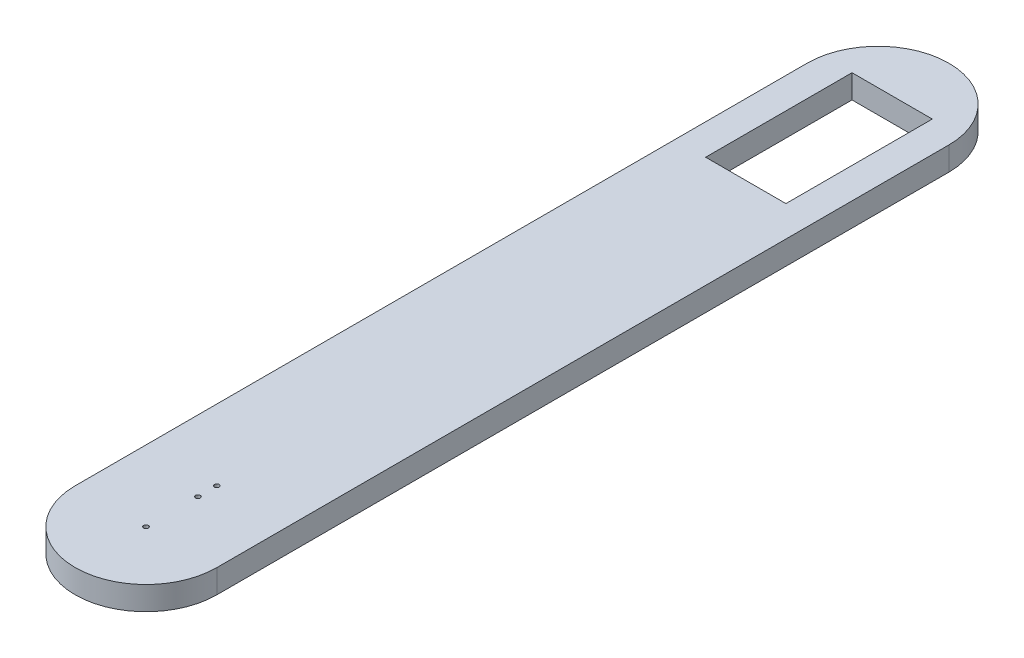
ISO-10303-21;
HEADER;
FILE_DESCRIPTION(('STEP AP214'),'2;1');
FILE_NAME('part.step','',(''),(''),'','','');
FILE_SCHEMA(('AUTOMOTIVE_DESIGN { 1 0 10303 214 1 1 1 1 }'));
ENDSEC;
DATA;
#1=APPLICATION_CONTEXT('core data for automotive mechanical design processes');
#2=APPLICATION_PROTOCOL_DEFINITION('international standard','automotive_design',2000,#1);
#3=PRODUCT_CONTEXT('',#1,'mechanical');
#4=PRODUCT('Part','Part','',(#3));
#5=PRODUCT_RELATED_PRODUCT_CATEGORY('part','',(#4));
#6=PRODUCT_DEFINITION_FORMATION('','',#4);
#7=PRODUCT_DEFINITION_CONTEXT('part definition',#1,'design');
#8=PRODUCT_DEFINITION('design','',#6,#7);
#9=PRODUCT_DEFINITION_SHAPE('','',#8);
#10=(LENGTH_UNIT() NAMED_UNIT(*) SI_UNIT(.MILLI.,.METRE.));
#11=(NAMED_UNIT(*) PLANE_ANGLE_UNIT() SI_UNIT($,.RADIAN.));
#12=(NAMED_UNIT(*) SI_UNIT($,.STERADIAN.) SOLID_ANGLE_UNIT());
#13=UNCERTAINTY_MEASURE_WITH_UNIT(LENGTH_MEASURE(1.E-05),#10,'distance_accuracy_value','');
#14=(GEOMETRIC_REPRESENTATION_CONTEXT(3) GLOBAL_UNCERTAINTY_ASSIGNED_CONTEXT((#13)) GLOBAL_UNIT_ASSIGNED_CONTEXT((#10,
#11,#12)) REPRESENTATION_CONTEXT('',''));
#15=CARTESIAN_POINT('',(0.,0.,0.));
#16=DIRECTION('',(0.,0.,1.));
#17=DIRECTION('',(1.,0.,0.));
#18=AXIS2_PLACEMENT_3D('',#15,#16,#17);
#19=CARTESIAN_POINT('',(15.,5.,0.));
#20=DIRECTION('',(0.,-1.,0.));
#21=DIRECTION('',(0.,0.,-1.));
#22=AXIS2_PLACEMENT_3D('',#19,#20,#21);
#23=CYLINDRICAL_SURFACE('',#22,15.);
#24=CARTESIAN_POINT('',(15.,0.,0.));
#25=DIRECTION('',(0.,1.,0.));
#26=DIRECTION('',(0.,0.,1.));
#27=AXIS2_PLACEMENT_3D('',#24,#25,#26);
#28=CIRCLE('',#27,15.);
#29=CARTESIAN_POINT('',(0.,0.,0.));
#30=VERTEX_POINT('',#29);
#31=CARTESIAN_POINT('',(30.,0.,0.));
#32=VERTEX_POINT('',#31);
#33=EDGE_CURVE('E156',#30,#32,#28,.T.);
#34=ORIENTED_EDGE('',*,*,#33,.T.);
#35=DIRECTION('',(0.,-1.,0.));
#36=VECTOR('',#35,1.);
#37=CARTESIAN_POINT('',(30.,5.,0.));
#38=LINE('',#37,#36);
#39=CARTESIAN_POINT('',(30.,5.,0.));
#40=VERTEX_POINT('',#39);
#41=EDGE_CURVE('E11',#40,#32,#38,.T.);
#42=ORIENTED_EDGE('',*,*,#41,.F.);
#43=CARTESIAN_POINT('',(15.,5.,0.));
#44=DIRECTION('',(0.,1.,0.));
#45=DIRECTION('',(0.,0.,1.));
#46=AXIS2_PLACEMENT_3D('',#43,#44,#45);
#47=CIRCLE('',#46,15.);
#48=CARTESIAN_POINT('',(0.,5.,0.));
#49=VERTEX_POINT('',#48);
#50=EDGE_CURVE('E144',#49,#40,#47,.T.);
#51=ORIENTED_EDGE('',*,*,#50,.F.);
#52=DIRECTION('',(0.,-1.,0.));
#53=VECTOR('',#52,1.);
#54=CARTESIAN_POINT('',(0.,5.,0.));
#55=LINE('',#54,#53);
#56=EDGE_CURVE('E155',#49,#30,#55,.T.);
#57=ORIENTED_EDGE('',*,*,#56,.T.);
#58=EDGE_LOOP('',(#34,#42,#51,#57));
#59=FACE_BOUND('',#58,.T.);
#60=ADVANCED_FACE('F32',(#59),#23,.T.);
#61=CARTESIAN_POINT('',(30.,5.,0.));
#62=DIRECTION('',(-1.,0.,0.));
#63=DIRECTION('',(0.,0.,1.));
#64=AXIS2_PLACEMENT_3D('',#61,#62,#63);
#65=PLANE('',#64);
#66=DIRECTION('',(0.,0.,-1.));
#67=VECTOR('',#66,1.);
#68=CARTESIAN_POINT('',(30.,0.,0.));
#69=LINE('',#68,#67);
#70=CARTESIAN_POINT('',(30.,0.,-155.));
#71=VERTEX_POINT('',#70);
#72=EDGE_CURVE('E159',#32,#71,#69,.T.);
#73=ORIENTED_EDGE('',*,*,#72,.T.);
#74=DIRECTION('',(0.,-1.,0.));
#75=VECTOR('',#74,1.);
#76=CARTESIAN_POINT('',(30.,5.,-155.));
#77=LINE('',#76,#75);
#78=CARTESIAN_POINT('',(30.,5.,-155.));
#79=VERTEX_POINT('',#78);
#80=EDGE_CURVE('E40',#79,#71,#77,.T.);
#81=ORIENTED_EDGE('',*,*,#80,.F.);
#82=DIRECTION('',(0.,0.,-1.));
#83=VECTOR('',#82,1.);
#84=CARTESIAN_POINT('',(30.,5.,0.));
#85=LINE('',#84,#83);
#86=EDGE_CURVE('E147',#40,#79,#85,.T.);
#87=ORIENTED_EDGE('',*,*,#86,.F.);
#88=ORIENTED_EDGE('',*,*,#41,.T.);
#89=EDGE_LOOP('',(#73,#81,#87,#88));
#90=FACE_BOUND('',#89,.T.);
#91=ADVANCED_FACE('F195',(#90),#65,.F.);
#92=CARTESIAN_POINT('',(15.,5.,-155.));
#93=DIRECTION('',(0.,-1.,0.));
#94=DIRECTION('',(0.,0.,-1.));
#95=AXIS2_PLACEMENT_3D('',#92,#93,#94);
#96=CYLINDRICAL_SURFACE('',#95,15.);
#97=CARTESIAN_POINT('',(15.,0.,-155.));
#98=DIRECTION('',(0.,1.,0.));
#99=DIRECTION('',(0.,0.,1.));
#100=AXIS2_PLACEMENT_3D('',#97,#98,#99);
#101=CIRCLE('',#100,15.);
#102=CARTESIAN_POINT('',(0.,0.,-155.));
#103=VERTEX_POINT('',#102);
#104=EDGE_CURVE('E161',#71,#103,#101,.T.);
#105=ORIENTED_EDGE('',*,*,#104,.T.);
#106=DIRECTION('',(0.,-1.,0.));
#107=VECTOR('',#106,1.);
#108=CARTESIAN_POINT('',(0.,5.,-155.));
#109=LINE('',#108,#107);
#110=CARTESIAN_POINT('',(0.,5.,-155.));
#111=VERTEX_POINT('',#110);
#112=EDGE_CURVE('E167',#111,#103,#109,.T.);
#113=ORIENTED_EDGE('',*,*,#112,.F.);
#114=CARTESIAN_POINT('',(15.,5.,-155.));
#115=DIRECTION('',(0.,1.,0.));
#116=DIRECTION('',(0.,0.,1.));
#117=AXIS2_PLACEMENT_3D('',#114,#115,#116);
#118=CIRCLE('',#117,15.);
#119=EDGE_CURVE('E150',#79,#111,#118,.T.);
#120=ORIENTED_EDGE('',*,*,#119,.F.);
#121=ORIENTED_EDGE('',*,*,#80,.T.);
#122=EDGE_LOOP('',(#105,#113,#120,#121));
#123=FACE_BOUND('',#122,.T.);
#124=ADVANCED_FACE('F200',(#123),#96,.T.);
#125=CARTESIAN_POINT('',(0.,5.,0.));
#126=DIRECTION('',(-1.,0.,0.));
#127=DIRECTION('',(0.,0.,1.));
#128=AXIS2_PLACEMENT_3D('',#125,#126,#127);
#129=PLANE('',#128);
#130=DIRECTION('',(0.,0.,-1.));
#131=VECTOR('',#130,1.);
#132=CARTESIAN_POINT('',(0.,0.,0.));
#133=LINE('',#132,#131);
#134=EDGE_CURVE('E148',#30,#103,#133,.T.);
#135=ORIENTED_EDGE('',*,*,#134,.F.);
#136=ORIENTED_EDGE('',*,*,#56,.F.);
#137=DIRECTION('',(0.,0.,-1.));
#138=VECTOR('',#137,1.);
#139=CARTESIAN_POINT('',(0.,5.,0.));
#140=LINE('',#139,#138);
#141=EDGE_CURVE('E152',#49,#111,#140,.T.);
#142=ORIENTED_EDGE('',*,*,#141,.T.);
#143=ORIENTED_EDGE('',*,*,#112,.T.);
#144=EDGE_LOOP('',(#135,#136,#142,#143));
#145=FACE_BOUND('',#144,.T.);
#146=ADVANCED_FACE('F209',(#145),#129,.T.);
#147=CARTESIAN_POINT('',(15.,5.,0.));
#148=DIRECTION('',(0.,1.,0.));
#149=DIRECTION('',(0.,0.,1.));
#150=AXIS2_PLACEMENT_3D('',#147,#148,#149);
#151=PLANE('',#150);
#152=DIRECTION('',(0.,0.,1.));
#153=VECTOR('',#152,1.);
#154=CARTESIAN_POINT('',(6.5,5.,-127.));
#155=LINE('',#154,#153);
#156=CARTESIAN_POINT('',(6.5,5.,-158.));
#157=VERTEX_POINT('',#156);
#158=CARTESIAN_POINT('',(6.5,5.,-127.));
#159=VERTEX_POINT('',#158);
#160=EDGE_CURVE('E48',#157,#159,#155,.T.);
#161=ORIENTED_EDGE('',*,*,#160,.F.);
#162=DIRECTION('',(-1.,0.,0.));
#163=VECTOR('',#162,1.);
#164=CARTESIAN_POINT('',(6.5,5.,-158.));
#165=LINE('',#164,#163);
#166=CARTESIAN_POINT('',(23.5,5.,-158.));
#167=VERTEX_POINT('',#166);
#168=EDGE_CURVE('E116',#167,#157,#165,.T.);
#169=ORIENTED_EDGE('',*,*,#168,.F.);
#170=DIRECTION('',(0.,0.,-1.));
#171=VECTOR('',#170,1.);
#172=CARTESIAN_POINT('',(23.5,5.,-158.));
#173=LINE('',#172,#171);
#174=CARTESIAN_POINT('',(23.5,5.,-127.));
#175=VERTEX_POINT('',#174);
#176=EDGE_CURVE('E119',#175,#167,#173,.T.);
#177=ORIENTED_EDGE('',*,*,#176,.F.);
#178=DIRECTION('',(1.,0.,0.));
#179=VECTOR('',#178,1.);
#180=CARTESIAN_POINT('',(23.5,5.,-127.));
#181=LINE('',#180,#179);
#182=EDGE_CURVE('E125',#159,#175,#181,.T.);
#183=ORIENTED_EDGE('',*,*,#182,.F.);
#184=EDGE_LOOP('',(#161,#169,#177,#183));
#185=FACE_BOUND('',#184,.T.);
#186=CARTESIAN_POINT('',(15.,5.,0.));
#187=DIRECTION('',(0.,1.,0.));
#188=DIRECTION('',(0.,0.,1.));
#189=AXIS2_PLACEMENT_3D('',#186,#187,#188);
#190=CIRCLE('',#189,0.500000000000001);
#191=CARTESIAN_POINT('',(15.,5.,0.500000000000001));
#192=VERTEX_POINT('',#191);
#193=EDGE_CURVE('E131',#192,#192,#190,.T.);
#194=ORIENTED_EDGE('',*,*,#193,.F.);
#195=EDGE_LOOP('',(#194));
#196=FACE_BOUND('',#195,.T.);
#197=CARTESIAN_POINT('',(15.,5.,-15.));
#198=DIRECTION('',(0.,1.,0.));
#199=DIRECTION('',(0.,0.,1.));
#200=AXIS2_PLACEMENT_3D('',#197,#198,#199);
#201=CIRCLE('',#200,0.500000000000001);
#202=CARTESIAN_POINT('',(15.,5.,-14.5));
#203=VERTEX_POINT('',#202);
#204=EDGE_CURVE('E135',#203,#203,#201,.T.);
#205=ORIENTED_EDGE('',*,*,#204,.F.);
#206=EDGE_LOOP('',(#205));
#207=FACE_BOUND('',#206,.T.);
#208=CARTESIAN_POINT('',(15.,5.,-11.));
#209=DIRECTION('',(0.,1.,0.));
#210=DIRECTION('',(0.,0.,1.));
#211=AXIS2_PLACEMENT_3D('',#208,#209,#210);
#212=CIRCLE('',#211,0.500000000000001);
#213=CARTESIAN_POINT('',(15.,5.,-10.5));
#214=VERTEX_POINT('',#213);
#215=EDGE_CURVE('E138',#214,#214,#212,.T.);
#216=ORIENTED_EDGE('',*,*,#215,.F.);
#217=EDGE_LOOP('',(#216));
#218=FACE_BOUND('',#217,.T.);
#219=ORIENTED_EDGE('',*,*,#50,.T.);
#220=ORIENTED_EDGE('',*,*,#86,.T.);
#221=ORIENTED_EDGE('',*,*,#119,.T.);
#222=ORIENTED_EDGE('',*,*,#141,.F.);
#223=EDGE_LOOP('',(#219,#220,#221,#222));
#224=FACE_BOUND('',#223,.T.);
#225=ADVANCED_FACE('F216',(#185,#196,#207,#218,#224),#151,.T.);
#226=CARTESIAN_POINT('',(15.,0.,0.));
#227=DIRECTION('',(0.,1.,0.));
#228=DIRECTION('',(0.,0.,1.));
#229=AXIS2_PLACEMENT_3D('',#226,#227,#228);
#230=PLANE('',#229);
#231=DIRECTION('',(-1.,0.,0.));
#232=VECTOR('',#231,1.);
#233=CARTESIAN_POINT('',(6.5,0.,-158.));
#234=LINE('',#233,#232);
#235=CARTESIAN_POINT('',(23.5,0.,-158.));
#236=VERTEX_POINT('',#235);
#237=CARTESIAN_POINT('',(6.5,0.,-158.));
#238=VERTEX_POINT('',#237);
#239=EDGE_CURVE('E106',#236,#238,#234,.T.);
#240=ORIENTED_EDGE('',*,*,#239,.T.);
#241=DIRECTION('',(0.,0.,1.));
#242=VECTOR('',#241,1.);
#243=CARTESIAN_POINT('',(6.5,0.,-127.));
#244=LINE('',#243,#242);
#245=CARTESIAN_POINT('',(6.5,0.,-127.));
#246=VERTEX_POINT('',#245);
#247=EDGE_CURVE('E100',#238,#246,#244,.T.);
#248=ORIENTED_EDGE('',*,*,#247,.T.);
#249=DIRECTION('',(1.,0.,0.));
#250=VECTOR('',#249,1.);
#251=CARTESIAN_POINT('',(23.5,0.,-127.));
#252=LINE('',#251,#250);
#253=CARTESIAN_POINT('',(23.5,0.,-127.));
#254=VERTEX_POINT('',#253);
#255=EDGE_CURVE('E109',#246,#254,#252,.T.);
#256=ORIENTED_EDGE('',*,*,#255,.T.);
#257=DIRECTION('',(0.,0.,-1.));
#258=VECTOR('',#257,1.);
#259=CARTESIAN_POINT('',(23.5,0.,-158.));
#260=LINE('',#259,#258);
#261=EDGE_CURVE('E56',#254,#236,#260,.T.);
#262=ORIENTED_EDGE('',*,*,#261,.T.);
#263=EDGE_LOOP('',(#240,#248,#256,#262));
#264=FACE_BOUND('',#263,.T.);
#265=CARTESIAN_POINT('',(15.,0.,0.));
#266=DIRECTION('',(0.,1.,0.));
#267=DIRECTION('',(0.,0.,1.));
#268=AXIS2_PLACEMENT_3D('',#265,#266,#267);
#269=CIRCLE('',#268,0.500000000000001);
#270=CARTESIAN_POINT('',(15.,0.,0.500000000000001));
#271=VERTEX_POINT('',#270);
#272=EDGE_CURVE('E35',#271,#271,#269,.T.);
#273=ORIENTED_EDGE('',*,*,#272,.T.);
#274=EDGE_LOOP('',(#273));
#275=FACE_BOUND('',#274,.T.);
#276=CARTESIAN_POINT('',(15.,0.,-15.));
#277=DIRECTION('',(0.,1.,0.));
#278=DIRECTION('',(0.,0.,1.));
#279=AXIS2_PLACEMENT_3D('',#276,#277,#278);
#280=CIRCLE('',#279,0.500000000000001);
#281=CARTESIAN_POINT('',(15.,0.,-14.5));
#282=VERTEX_POINT('',#281);
#283=EDGE_CURVE('E172',#282,#282,#280,.T.);
#284=ORIENTED_EDGE('',*,*,#283,.T.);
#285=EDGE_LOOP('',(#284));
#286=FACE_BOUND('',#285,.T.);
#287=CARTESIAN_POINT('',(15.,0.,-11.));
#288=DIRECTION('',(0.,1.,0.));
#289=DIRECTION('',(0.,0.,1.));
#290=AXIS2_PLACEMENT_3D('',#287,#288,#289);
#291=CIRCLE('',#290,0.500000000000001);
#292=CARTESIAN_POINT('',(15.,0.,-10.5));
#293=VERTEX_POINT('',#292);
#294=EDGE_CURVE('E143',#293,#293,#291,.T.);
#295=ORIENTED_EDGE('',*,*,#294,.T.);
#296=EDGE_LOOP('',(#295));
#297=FACE_BOUND('',#296,.T.);
#298=ORIENTED_EDGE('',*,*,#33,.F.);
#299=ORIENTED_EDGE('',*,*,#134,.T.);
#300=ORIENTED_EDGE('',*,*,#104,.F.);
#301=ORIENTED_EDGE('',*,*,#72,.F.);
#302=EDGE_LOOP('',(#298,#299,#300,#301));
#303=FACE_BOUND('',#302,.T.);
#304=ADVANCED_FACE('F113',(#264,#275,#286,#297,#303),#230,.F.);
#305=CARTESIAN_POINT('',(15.,-5.,-11.));
#306=DIRECTION('',(0.,1.,0.));
#307=DIRECTION('',(0.,0.,1.));
#308=AXIS2_PLACEMENT_3D('',#305,#306,#307);
#309=CYLINDRICAL_SURFACE('',#308,0.500000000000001);
#310=ORIENTED_EDGE('',*,*,#215,.T.);
#311=EDGE_LOOP('',(#310));
#312=FACE_BOUND('',#311,.T.);
#313=ORIENTED_EDGE('',*,*,#294,.F.);
#314=EDGE_LOOP('',(#313));
#315=FACE_BOUND('',#314,.T.);
#316=ADVANCED_FACE('F190',(#312,#315),#309,.F.);
#317=CARTESIAN_POINT('',(15.,-5.,-15.));
#318=DIRECTION('',(0.,1.,0.));
#319=DIRECTION('',(0.,0.,1.));
#320=AXIS2_PLACEMENT_3D('',#317,#318,#319);
#321=CYLINDRICAL_SURFACE('',#320,0.500000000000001);
#322=ORIENTED_EDGE('',*,*,#204,.T.);
#323=EDGE_LOOP('',(#322));
#324=FACE_BOUND('',#323,.T.);
#325=ORIENTED_EDGE('',*,*,#283,.F.);
#326=EDGE_LOOP('',(#325));
#327=FACE_BOUND('',#326,.T.);
#328=ADVANCED_FACE('F181',(#324,#327),#321,.F.);
#329=CARTESIAN_POINT('',(15.,-5.,0.));
#330=DIRECTION('',(0.,1.,0.));
#331=DIRECTION('',(0.,0.,1.));
#332=AXIS2_PLACEMENT_3D('',#329,#330,#331);
#333=CYLINDRICAL_SURFACE('',#332,0.500000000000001);
#334=ORIENTED_EDGE('',*,*,#193,.T.);
#335=EDGE_LOOP('',(#334));
#336=FACE_BOUND('',#335,.T.);
#337=ORIENTED_EDGE('',*,*,#272,.F.);
#338=EDGE_LOOP('',(#337));
#339=FACE_BOUND('',#338,.T.);
#340=ADVANCED_FACE('F179',(#336,#339),#333,.F.);
#341=CARTESIAN_POINT('',(6.5,0.,-127.));
#342=DIRECTION('',(-1.,0.,0.));
#343=DIRECTION('',(0.,0.,1.));
#344=AXIS2_PLACEMENT_3D('',#341,#342,#343);
#345=PLANE('',#344);
#346=ORIENTED_EDGE('',*,*,#160,.T.);
#347=DIRECTION('',(0.,1.,0.));
#348=VECTOR('',#347,1.);
#349=CARTESIAN_POINT('',(6.5,0.,-127.));
#350=LINE('',#349,#348);
#351=EDGE_CURVE('E96',#246,#159,#350,.T.);
#352=ORIENTED_EDGE('',*,*,#351,.F.);
#353=ORIENTED_EDGE('',*,*,#247,.F.);
#354=DIRECTION('',(0.,1.,0.));
#355=VECTOR('',#354,1.);
#356=CARTESIAN_POINT('',(6.5,0.,-158.));
#357=LINE('',#356,#355);
#358=EDGE_CURVE('E129',#238,#157,#357,.T.);
#359=ORIENTED_EDGE('',*,*,#358,.T.);
#360=EDGE_LOOP('',(#346,#352,#353,#359));
#361=FACE_BOUND('',#360,.T.);
#362=ADVANCED_FACE('F98',(#361),#345,.F.);
#363=CARTESIAN_POINT('',(6.5,0.,-158.));
#364=DIRECTION('',(0.,0.,-1.));
#365=DIRECTION('',(-1.,0.,0.));
#366=AXIS2_PLACEMENT_3D('',#363,#364,#365);
#367=PLANE('',#366);
#368=ORIENTED_EDGE('',*,*,#168,.T.);
#369=ORIENTED_EDGE('',*,*,#358,.F.);
#370=ORIENTED_EDGE('',*,*,#239,.F.);
#371=DIRECTION('',(0.,1.,0.));
#372=VECTOR('',#371,1.);
#373=CARTESIAN_POINT('',(23.5,0.,-158.));
#374=LINE('',#373,#372);
#375=EDGE_CURVE('E132',#236,#167,#374,.T.);
#376=ORIENTED_EDGE('',*,*,#375,.T.);
#377=EDGE_LOOP('',(#368,#369,#370,#376));
#378=FACE_BOUND('',#377,.T.);
#379=ADVANCED_FACE('F188',(#378),#367,.F.);
#380=CARTESIAN_POINT('',(23.5,0.,-158.));
#381=DIRECTION('',(1.,0.,0.));
#382=DIRECTION('',(0.,0.,-1.));
#383=AXIS2_PLACEMENT_3D('',#380,#381,#382);
#384=PLANE('',#383);
#385=ORIENTED_EDGE('',*,*,#176,.T.);
#386=ORIENTED_EDGE('',*,*,#375,.F.);
#387=ORIENTED_EDGE('',*,*,#261,.F.);
#388=DIRECTION('',(0.,1.,0.));
#389=VECTOR('',#388,1.);
#390=CARTESIAN_POINT('',(23.5,0.,-127.));
#391=LINE('',#390,#389);
#392=EDGE_CURVE('E105',#254,#175,#391,.T.);
#393=ORIENTED_EDGE('',*,*,#392,.T.);
#394=EDGE_LOOP('',(#385,#386,#387,#393));
#395=FACE_BOUND('',#394,.T.);
#396=ADVANCED_FACE('F280',(#395),#384,.F.);
#397=CARTESIAN_POINT('',(23.5,0.,-127.));
#398=DIRECTION('',(0.,0.,1.));
#399=DIRECTION('',(1.,0.,0.));
#400=AXIS2_PLACEMENT_3D('',#397,#398,#399);
#401=PLANE('',#400);
#402=ORIENTED_EDGE('',*,*,#182,.T.);
#403=ORIENTED_EDGE('',*,*,#392,.F.);
#404=ORIENTED_EDGE('',*,*,#255,.F.);
#405=ORIENTED_EDGE('',*,*,#351,.T.);
#406=EDGE_LOOP('',(#402,#403,#404,#405));
#407=FACE_BOUND('',#406,.T.);
#408=ADVANCED_FACE('F110',(#407),#401,.F.);
#409=CLOSED_SHELL('',(#60,#91,#124,#146,#225,#304,#316,#328,#340,#362,#379,#396,#408));
#410=MANIFOLD_SOLID_BREP('B2',#409);
#411=ADVANCED_BREP_SHAPE_REPRESENTATION('',(#18,#410),#14);
#412=SHAPE_DEFINITION_REPRESENTATION(#9,#411);
ENDSEC;
END-ISO-10303-21;
